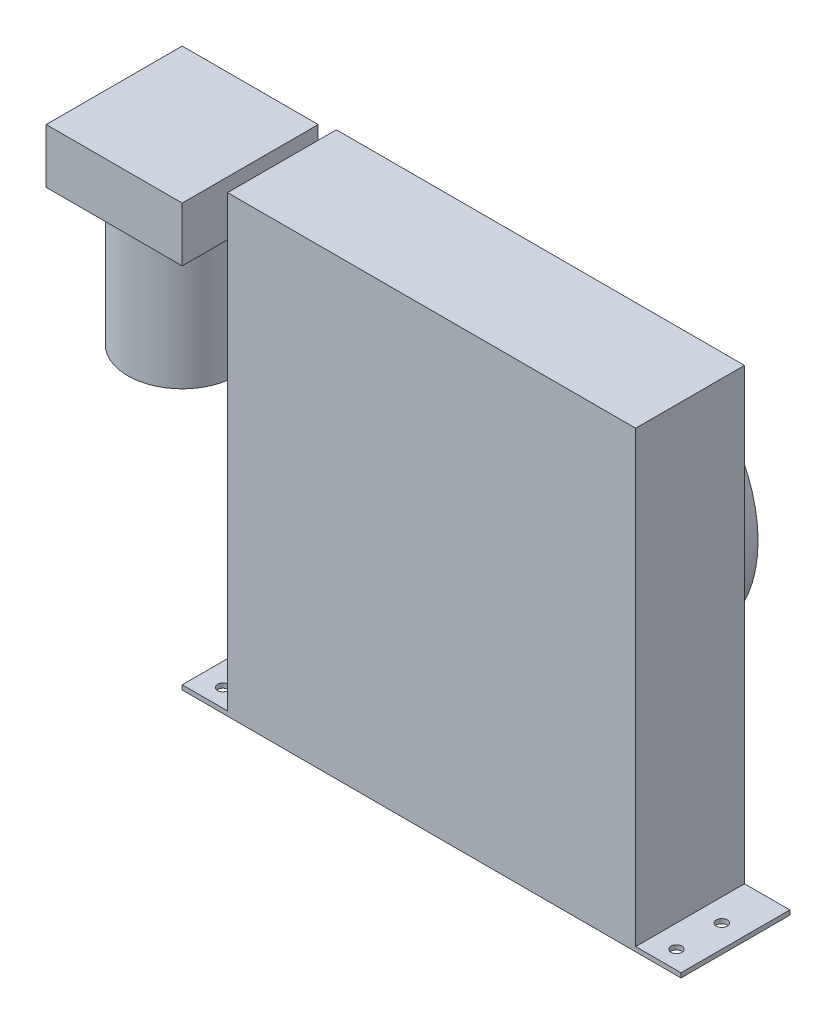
ISO-10303-21;
HEADER;
FILE_DESCRIPTION(('STEP AP214'),'2;1');
FILE_NAME('part.step','',(''),(''),'','','');
FILE_SCHEMA(('AUTOMOTIVE_DESIGN { 1 0 10303 214 1 1 1 1 }'));
ENDSEC;
DATA;
#1=APPLICATION_CONTEXT('core data for automotive mechanical design processes');
#2=APPLICATION_PROTOCOL_DEFINITION('international standard','automotive_design',2000,#1);
#3=PRODUCT_CONTEXT('',#1,'mechanical');
#4=PRODUCT('Part','Part','',(#3));
#5=PRODUCT_RELATED_PRODUCT_CATEGORY('part','',(#4));
#6=PRODUCT_DEFINITION_FORMATION('','',#4);
#7=PRODUCT_DEFINITION_CONTEXT('part definition',#1,'design');
#8=PRODUCT_DEFINITION('design','',#6,#7);
#9=PRODUCT_DEFINITION_SHAPE('','',#8);
#10=(LENGTH_UNIT() NAMED_UNIT(*) SI_UNIT(.MILLI.,.METRE.));
#11=(NAMED_UNIT(*) PLANE_ANGLE_UNIT() SI_UNIT($,.RADIAN.));
#12=(NAMED_UNIT(*) SI_UNIT($,.STERADIAN.) SOLID_ANGLE_UNIT());
#13=UNCERTAINTY_MEASURE_WITH_UNIT(LENGTH_MEASURE(1.E-05),#10,'distance_accuracy_value','');
#14=(GEOMETRIC_REPRESENTATION_CONTEXT(3) GLOBAL_UNCERTAINTY_ASSIGNED_CONTEXT((#13)) GLOBAL_UNIT_ASSIGNED_CONTEXT((#10,
#11,#12)) REPRESENTATION_CONTEXT('',''));
#15=CARTESIAN_POINT('',(0.,0.,0.));
#16=DIRECTION('',(0.,0.,1.));
#17=DIRECTION('',(1.,0.,0.));
#18=AXIS2_PLACEMENT_3D('',#15,#16,#17);
#19=CARTESIAN_POINT('',(-225.,-250.,120.));
#20=DIRECTION('',(0.,1.,0.));
#21=DIRECTION('',(0.,0.,1.));
#22=AXIS2_PLACEMENT_3D('',#19,#20,#21);
#23=PLANE('',#22);
#24=CARTESIAN_POINT('',(250.,-250.,50.));
#25=DIRECTION('',(0.,1.,0.));
#26=DIRECTION('',(0.,0.,-1.));
#27=AXIS2_PLACEMENT_3D('',#24,#25,#26);
#28=CIRCLE('',#27,6.00000000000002);
#29=CARTESIAN_POINT('',(250.,-250.,44.));
#30=VERTEX_POINT('',#29);
#31=EDGE_CURVE('E180',#30,#30,#28,.T.);
#32=ORIENTED_EDGE('',*,*,#31,.T.);
#33=EDGE_LOOP('',(#32));
#34=FACE_BOUND('',#33,.T.);
#35=CARTESIAN_POINT('',(-250.,-250.,100.));
#36=DIRECTION('',(0.,-1.,0.));
#37=DIRECTION('',(0.,0.,-1.));
#38=AXIS2_PLACEMENT_3D('',#35,#36,#37);
#39=CIRCLE('',#38,6.00000000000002);
#40=CARTESIAN_POINT('',(-250.,-250.,94.));
#41=VERTEX_POINT('',#40);
#42=EDGE_CURVE('E166',#41,#41,#39,.T.);
#43=ORIENTED_EDGE('',*,*,#42,.F.);
#44=EDGE_LOOP('',(#43));
#45=FACE_BOUND('',#44,.T.);
#46=CARTESIAN_POINT('',(-250.,-250.,50.));
#47=DIRECTION('',(0.,-1.,0.));
#48=DIRECTION('',(0.,0.,-1.));
#49=AXIS2_PLACEMENT_3D('',#46,#47,#48);
#50=CIRCLE('',#49,6.00000000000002);
#51=CARTESIAN_POINT('',(-250.,-250.,44.));
#52=VERTEX_POINT('',#51);
#53=EDGE_CURVE('E432',#52,#52,#50,.T.);
#54=ORIENTED_EDGE('',*,*,#53,.F.);
#55=EDGE_LOOP('',(#54));
#56=FACE_BOUND('',#55,.T.);
#57=DIRECTION('',(1.,0.,0.));
#58=VECTOR('',#57,1.);
#59=CARTESIAN_POINT('',(-225.,-250.,0.));
#60=LINE('',#59,#58);
#61=CARTESIAN_POINT('',(-275.,-250.,0.));
#62=VERTEX_POINT('',#61);
#63=CARTESIAN_POINT('',(275.,-250.,0.));
#64=VERTEX_POINT('',#63);
#65=EDGE_CURVE('E156',#62,#64,#60,.T.);
#66=ORIENTED_EDGE('',*,*,#65,.T.);
#67=DIRECTION('',(0.,0.,1.));
#68=VECTOR('',#67,1.);
#69=CARTESIAN_POINT('',(275.,-250.,120.));
#70=LINE('',#69,#68);
#71=CARTESIAN_POINT('',(275.,-250.,120.));
#72=VERTEX_POINT('',#71);
#73=EDGE_CURVE('E150',#64,#72,#70,.T.);
#74=ORIENTED_EDGE('',*,*,#73,.T.);
#75=DIRECTION('',(1.,0.,0.));
#76=VECTOR('',#75,1.);
#77=CARTESIAN_POINT('',(-225.,-250.,120.));
#78=LINE('',#77,#76);
#79=CARTESIAN_POINT('',(-275.,-250.,120.));
#80=VERTEX_POINT('',#79);
#81=EDGE_CURVE('E131',#80,#72,#78,.T.);
#82=ORIENTED_EDGE('',*,*,#81,.F.);
#83=DIRECTION('',(0.,0.,1.));
#84=VECTOR('',#83,1.);
#85=CARTESIAN_POINT('',(-275.,-250.,120.));
#86=LINE('',#85,#84);
#87=EDGE_CURVE('E486',#62,#80,#86,.T.);
#88=ORIENTED_EDGE('',*,*,#87,.F.);
#89=EDGE_LOOP('',(#66,#74,#82,#88));
#90=FACE_BOUND('',#89,.T.);
#91=CARTESIAN_POINT('',(250.,-250.,100.));
#92=DIRECTION('',(0.,1.,0.));
#93=DIRECTION('',(0.,0.,-1.));
#94=AXIS2_PLACEMENT_3D('',#91,#92,#93);
#95=CIRCLE('',#94,6.00000000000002);
#96=CARTESIAN_POINT('',(250.,-250.,94.));
#97=VERTEX_POINT('',#96);
#98=EDGE_CURVE('E187',#97,#97,#95,.T.);
#99=ORIENTED_EDGE('',*,*,#98,.T.);
#100=EDGE_LOOP('',(#99));
#101=FACE_BOUND('',#100,.T.);
#102=ADVANCED_FACE('F39',(#34,#45,#56,#90,#101),#23,.F.);
#103=CARTESIAN_POINT('',(275.,-245.,120.));
#104=DIRECTION('',(0.,1.,0.));
#105=DIRECTION('',(0.,0.,1.));
#106=AXIS2_PLACEMENT_3D('',#103,#104,#105);
#107=PLANE('',#106);
#108=CARTESIAN_POINT('',(250.,-245.,50.));
#109=DIRECTION('',(0.,1.,0.));
#110=DIRECTION('',(0.,0.,1.));
#111=AXIS2_PLACEMENT_3D('',#108,#109,#110);
#112=CIRCLE('',#111,6.00000000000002);
#113=CARTESIAN_POINT('',(250.,-245.,56.));
#114=VERTEX_POINT('',#113);
#115=EDGE_CURVE('E171',#114,#114,#112,.F.);
#116=ORIENTED_EDGE('',*,*,#115,.T.);
#117=EDGE_LOOP('',(#116));
#118=FACE_BOUND('',#117,.T.);
#119=DIRECTION('',(0.,0.,-1.));
#120=VECTOR('',#119,1.);
#121=CARTESIAN_POINT('',(225.,-245.,120.));
#122=LINE('',#121,#120);
#123=CARTESIAN_POINT('',(225.,-245.,120.));
#124=VERTEX_POINT('',#123);
#125=CARTESIAN_POINT('',(225.,-245.,0.));
#126=VERTEX_POINT('',#125);
#127=EDGE_CURVE('E153',#124,#126,#122,.T.);
#128=ORIENTED_EDGE('',*,*,#127,.F.);
#129=DIRECTION('',(-1.,0.,0.));
#130=VECTOR('',#129,1.);
#131=CARTESIAN_POINT('',(275.,-245.,120.));
#132=LINE('',#131,#130);
#133=CARTESIAN_POINT('',(275.,-245.,120.));
#134=VERTEX_POINT('',#133);
#135=EDGE_CURVE('E163',#134,#124,#132,.T.);
#136=ORIENTED_EDGE('',*,*,#135,.F.);
#137=DIRECTION('',(0.,0.,-1.));
#138=VECTOR('',#137,1.);
#139=CARTESIAN_POINT('',(275.,-245.,120.));
#140=LINE('',#139,#138);
#141=CARTESIAN_POINT('',(275.,-245.,0.));
#142=VERTEX_POINT('',#141);
#143=EDGE_CURVE('E152',#134,#142,#140,.T.);
#144=ORIENTED_EDGE('',*,*,#143,.T.);
#145=DIRECTION('',(-1.,0.,0.));
#146=VECTOR('',#145,1.);
#147=CARTESIAN_POINT('',(275.,-245.,0.));
#148=LINE('',#147,#146);
#149=EDGE_CURVE('E56',#142,#126,#148,.T.);
#150=ORIENTED_EDGE('',*,*,#149,.T.);
#151=EDGE_LOOP('',(#128,#136,#144,#150));
#152=FACE_BOUND('',#151,.T.);
#153=CARTESIAN_POINT('',(250.,-245.,100.));
#154=DIRECTION('',(0.,1.,0.));
#155=DIRECTION('',(0.,0.,1.));
#156=AXIS2_PLACEMENT_3D('',#153,#154,#155);
#157=CIRCLE('',#156,6.00000000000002);
#158=CARTESIAN_POINT('',(250.,-245.,106.));
#159=VERTEX_POINT('',#158);
#160=EDGE_CURVE('E43',#159,#159,#157,.F.);
#161=ORIENTED_EDGE('',*,*,#160,.T.);
#162=EDGE_LOOP('',(#161));
#163=FACE_BOUND('',#162,.T.);
#164=ADVANCED_FACE('F204',(#118,#152,#163),#107,.T.);
#165=CARTESIAN_POINT('',(-225.,250.,120.));
#166=DIRECTION('',(1.,0.,0.));
#167=DIRECTION('',(0.,1.,0.));
#168=AXIS2_PLACEMENT_3D('',#165,#166,#167);
#169=PLANE('',#168);
#170=CARTESIAN_POINT('',(-225.,190.,60.));
#171=DIRECTION('',(1.,0.,0.));
#172=DIRECTION('',(0.,1.,0.));
#173=AXIS2_PLACEMENT_3D('',#170,#171,#172);
#174=CIRCLE('',#173,20.);
#175=CARTESIAN_POINT('',(-225.,210.,60.));
#176=VERTEX_POINT('',#175);
#177=EDGE_CURVE('E11',#176,#176,#174,.F.);
#178=ORIENTED_EDGE('',*,*,#177,.F.);
#179=EDGE_LOOP('',(#178));
#180=FACE_BOUND('',#179,.T.);
#181=DIRECTION('',(0.,0.,-1.));
#182=VECTOR('',#181,1.);
#183=CARTESIAN_POINT('',(-225.,-245.,120.));
#184=LINE('',#183,#182);
#185=CARTESIAN_POINT('',(-225.,-245.,120.));
#186=VERTEX_POINT('',#185);
#187=CARTESIAN_POINT('',(-225.,-245.,0.));
#188=VERTEX_POINT('',#187);
#189=EDGE_CURVE('E405',#186,#188,#184,.T.);
#190=ORIENTED_EDGE('',*,*,#189,.F.);
#191=DIRECTION('',(0.,-1.,0.));
#192=VECTOR('',#191,1.);
#193=CARTESIAN_POINT('',(-225.,250.,120.));
#194=LINE('',#193,#192);
#195=CARTESIAN_POINT('',(-225.,250.,120.));
#196=VERTEX_POINT('',#195);
#197=EDGE_CURVE('E144',#196,#186,#194,.T.);
#198=ORIENTED_EDGE('',*,*,#197,.F.);
#199=DIRECTION('',(0.,0.,-1.));
#200=VECTOR('',#199,1.);
#201=CARTESIAN_POINT('',(-225.,250.,120.));
#202=LINE('',#201,#200);
#203=CARTESIAN_POINT('',(-225.,250.,0.));
#204=VERTEX_POINT('',#203);
#205=EDGE_CURVE('E423',#196,#204,#202,.T.);
#206=ORIENTED_EDGE('',*,*,#205,.T.);
#207=DIRECTION('',(0.,-1.,0.));
#208=VECTOR('',#207,1.);
#209=CARTESIAN_POINT('',(-225.,250.,0.));
#210=LINE('',#209,#208);
#211=EDGE_CURVE('E408',#204,#188,#210,.T.);
#212=ORIENTED_EDGE('',*,*,#211,.T.);
#213=EDGE_LOOP('',(#190,#198,#206,#212));
#214=FACE_BOUND('',#213,.T.);
#215=ADVANCED_FACE('F41',(#180,#214),#169,.F.);
#216=CARTESIAN_POINT('',(-415.,165.,130.));
#217=DIRECTION('',(0.,-1.,0.));
#218=DIRECTION('',(0.,0.,-1.));
#219=AXIS2_PLACEMENT_3D('',#216,#217,#218);
#220=PLANE('',#219);
#221=DIRECTION('',(0.,0.,1.));
#222=VECTOR('',#221,1.);
#223=CARTESIAN_POINT('',(-415.,165.,130.));
#224=LINE('',#223,#222);
#225=CARTESIAN_POINT('',(-415.,165.,-20.));
#226=VERTEX_POINT('',#225);
#227=CARTESIAN_POINT('',(-415.,165.,130.));
#228=VERTEX_POINT('',#227);
#229=EDGE_CURVE('E462',#226,#228,#224,.T.);
#230=ORIENTED_EDGE('',*,*,#229,.F.);
#231=DIRECTION('',(-1.,0.,0.));
#232=VECTOR('',#231,1.);
#233=CARTESIAN_POINT('',(-415.,165.,-20.));
#234=LINE('',#233,#232);
#235=CARTESIAN_POINT('',(-265.,165.,-20.));
#236=VERTEX_POINT('',#235);
#237=EDGE_CURVE('E449',#236,#226,#234,.T.);
#238=ORIENTED_EDGE('',*,*,#237,.F.);
#239=DIRECTION('',(0.,0.,-1.));
#240=VECTOR('',#239,1.);
#241=CARTESIAN_POINT('',(-265.,165.,130.));
#242=LINE('',#241,#240);
#243=CARTESIAN_POINT('',(-265.,165.,130.));
#244=VERTEX_POINT('',#243);
#245=EDGE_CURVE('E456',#244,#236,#242,.T.);
#246=ORIENTED_EDGE('',*,*,#245,.F.);
#247=DIRECTION('',(1.,0.,0.));
#248=VECTOR('',#247,1.);
#249=CARTESIAN_POINT('',(-415.,165.,130.));
#250=LINE('',#249,#248);
#251=EDGE_CURVE('E459',#228,#244,#250,.T.);
#252=ORIENTED_EDGE('',*,*,#251,.F.);
#253=EDGE_LOOP('',(#230,#238,#246,#252));
#254=FACE_BOUND('',#253,.T.);
#255=CARTESIAN_POINT('',(-340.,165.,55.));
#256=DIRECTION('',(0.,-1.,0.));
#257=DIRECTION('',(0.,0.,-1.));
#258=AXIS2_PLACEMENT_3D('',#255,#256,#257);
#259=CIRCLE('',#258,60.);
#260=CARTESIAN_POINT('',(-340.,165.,-5.00000000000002));
#261=VERTEX_POINT('',#260);
#262=EDGE_CURVE('E480',#261,#261,#259,.T.);
#263=ORIENTED_EDGE('',*,*,#262,.F.);
#264=EDGE_LOOP('',(#263));
#265=FACE_BOUND('',#264,.T.);
#266=ADVANCED_FACE('F226',(#254,#265),#220,.T.);
#267=CARTESIAN_POINT('',(-225.,-250.,0.));
#268=DIRECTION('',(0.,0.,1.));
#269=DIRECTION('',(1.,0.,0.));
#270=AXIS2_PLACEMENT_3D('',#267,#268,#269);
#271=PLANE('',#270);
#272=ORIENTED_EDGE('',*,*,#211,.F.);
#273=DIRECTION('',(-1.,0.,0.));
#274=VECTOR('',#273,1.);
#275=CARTESIAN_POINT('',(-225.,250.,0.));
#276=LINE('',#275,#274);
#277=CARTESIAN_POINT('',(225.,250.,0.));
#278=VERTEX_POINT('',#277);
#279=EDGE_CURVE('E415',#278,#204,#276,.T.);
#280=ORIENTED_EDGE('',*,*,#279,.F.);
#281=DIRECTION('',(0.,1.,0.));
#282=VECTOR('',#281,1.);
#283=CARTESIAN_POINT('',(225.,250.,0.));
#284=LINE('',#283,#282);
#285=EDGE_CURVE('E417',#126,#278,#284,.T.);
#286=ORIENTED_EDGE('',*,*,#285,.F.);
#287=ORIENTED_EDGE('',*,*,#149,.F.);
#288=DIRECTION('',(0.,-1.,0.));
#289=VECTOR('',#288,1.);
#290=CARTESIAN_POINT('',(275.,-250.,0.));
#291=LINE('',#290,#289);
#292=EDGE_CURVE('E157',#142,#64,#291,.T.);
#293=ORIENTED_EDGE('',*,*,#292,.T.);
#294=ORIENTED_EDGE('',*,*,#65,.F.);
#295=DIRECTION('',(0.,-1.,0.));
#296=VECTOR('',#295,1.);
#297=CARTESIAN_POINT('',(-275.,-250.,0.));
#298=LINE('',#297,#296);
#299=CARTESIAN_POINT('',(-275.,-245.,0.));
#300=VERTEX_POINT('',#299);
#301=EDGE_CURVE('E488',#300,#62,#298,.T.);
#302=ORIENTED_EDGE('',*,*,#301,.F.);
#303=DIRECTION('',(1.,0.,0.));
#304=VECTOR('',#303,1.);
#305=CARTESIAN_POINT('',(-275.,-245.,0.));
#306=LINE('',#305,#304);
#307=EDGE_CURVE('E484',#300,#188,#306,.T.);
#308=ORIENTED_EDGE('',*,*,#307,.T.);
#309=EDGE_LOOP('',(#272,#280,#286,#287,#293,#294,#302,#308));
#310=FACE_BOUND('',#309,.T.);
#311=CARTESIAN_POINT('',(0.,0.,0.));
#312=DIRECTION('',(0.,0.,1.));
#313=DIRECTION('',(1.,0.,0.));
#314=AXIS2_PLACEMENT_3D('',#311,#312,#313);
#315=CIRCLE('',#314,150.);
#316=CARTESIAN_POINT('',(150.,0.,0.));
#317=VERTEX_POINT('',#316);
#318=EDGE_CURVE('E48',#317,#317,#315,.F.);
#319=ORIENTED_EDGE('',*,*,#318,.F.);
#320=EDGE_LOOP('',(#319));
#321=FACE_BOUND('',#320,.T.);
#322=ADVANCED_FACE('F216',(#310,#321),#271,.F.);
#323=CARTESIAN_POINT('',(225.,250.,120.));
#324=DIRECTION('',(-1.,0.,0.));
#325=DIRECTION('',(0.,-1.,0.));
#326=AXIS2_PLACEMENT_3D('',#323,#324,#325);
#327=PLANE('',#326);
#328=DIRECTION('',(0.,1.,0.));
#329=VECTOR('',#328,1.);
#330=CARTESIAN_POINT('',(225.,250.,120.));
#331=LINE('',#330,#329);
#332=CARTESIAN_POINT('',(225.,250.,120.));
#333=VERTEX_POINT('',#332);
#334=EDGE_CURVE('E143',#124,#333,#331,.T.);
#335=ORIENTED_EDGE('',*,*,#334,.F.);
#336=ORIENTED_EDGE('',*,*,#127,.T.);
#337=ORIENTED_EDGE('',*,*,#285,.T.);
#338=DIRECTION('',(0.,0.,-1.));
#339=VECTOR('',#338,1.);
#340=CARTESIAN_POINT('',(225.,250.,120.));
#341=LINE('',#340,#339);
#342=EDGE_CURVE('E425',#333,#278,#341,.T.);
#343=ORIENTED_EDGE('',*,*,#342,.F.);
#344=EDGE_LOOP('',(#335,#336,#337,#343));
#345=FACE_BOUND('',#344,.T.);
#346=ADVANCED_FACE('F212',(#345),#327,.F.);
#347=CARTESIAN_POINT('',(-225.,250.,120.));
#348=DIRECTION('',(0.,-1.,0.));
#349=DIRECTION('',(0.,0.,-1.));
#350=AXIS2_PLACEMENT_3D('',#347,#348,#349);
#351=PLANE('',#350);
#352=ORIENTED_EDGE('',*,*,#279,.T.);
#353=ORIENTED_EDGE('',*,*,#205,.F.);
#354=DIRECTION('',(-1.,0.,0.));
#355=VECTOR('',#354,1.);
#356=CARTESIAN_POINT('',(-225.,250.,120.));
#357=LINE('',#356,#355);
#358=EDGE_CURVE('E64',#333,#196,#357,.T.);
#359=ORIENTED_EDGE('',*,*,#358,.F.);
#360=ORIENTED_EDGE('',*,*,#342,.T.);
#361=EDGE_LOOP('',(#352,#353,#359,#360));
#362=FACE_BOUND('',#361,.T.);
#363=ADVANCED_FACE('F215',(#362),#351,.F.);
#364=CARTESIAN_POINT('',(-225.,-250.,120.));
#365=DIRECTION('',(0.,0.,1.));
#366=DIRECTION('',(1.,0.,0.));
#367=AXIS2_PLACEMENT_3D('',#364,#365,#366);
#368=PLANE('',#367);
#369=ORIENTED_EDGE('',*,*,#197,.T.);
#370=DIRECTION('',(1.,0.,0.));
#371=VECTOR('',#370,1.);
#372=CARTESIAN_POINT('',(-275.,-245.,120.));
#373=LINE('',#372,#371);
#374=CARTESIAN_POINT('',(-275.,-245.,120.));
#375=VERTEX_POINT('',#374);
#376=EDGE_CURVE('E414',#375,#186,#373,.T.);
#377=ORIENTED_EDGE('',*,*,#376,.F.);
#378=DIRECTION('',(0.,1.,0.));
#379=VECTOR('',#378,1.);
#380=CARTESIAN_POINT('',(-275.,-250.,120.));
#381=LINE('',#380,#379);
#382=EDGE_CURVE('E138',#80,#375,#381,.T.);
#383=ORIENTED_EDGE('',*,*,#382,.F.);
#384=ORIENTED_EDGE('',*,*,#81,.T.);
#385=DIRECTION('',(0.,1.,0.));
#386=VECTOR('',#385,1.);
#387=CARTESIAN_POINT('',(275.,-250.,120.));
#388=LINE('',#387,#386);
#389=EDGE_CURVE('E134',#72,#134,#388,.T.);
#390=ORIENTED_EDGE('',*,*,#389,.T.);
#391=ORIENTED_EDGE('',*,*,#135,.T.);
#392=ORIENTED_EDGE('',*,*,#334,.T.);
#393=ORIENTED_EDGE('',*,*,#358,.T.);
#394=EDGE_LOOP('',(#369,#377,#383,#384,#390,#391,#392,#393));
#395=FACE_BOUND('',#394,.T.);
#396=ADVANCED_FACE('F133',(#395),#368,.T.);
#397=CARTESIAN_POINT('',(0.,0.,-90.));
#398=DIRECTION('',(0.,0.,1.));
#399=DIRECTION('',(1.,0.,0.));
#400=AXIS2_PLACEMENT_3D('',#397,#398,#399);
#401=CYLINDRICAL_SURFACE('',#400,150.);
#402=CARTESIAN_POINT('',(0.,0.,-90.));
#403=DIRECTION('',(0.,0.,-1.));
#404=DIRECTION('',(-1.,0.,0.));
#405=AXIS2_PLACEMENT_3D('',#402,#403,#404);
#406=CIRCLE('',#405,150.);
#407=CARTESIAN_POINT('',(150.,0.,-90.));
#408=VERTEX_POINT('',#407);
#409=EDGE_CURVE('E439',#408,#408,#406,.T.);
#410=CARTESIAN_POINT('',(150.,0.,-90.));
#411=CARTESIAN_POINT('',(150.,0.,-89.0625));
#412=CARTESIAN_POINT('',(150.,0.,-88.125));
#413=CARTESIAN_POINT('',(150.,0.,-86.25));
#414=CARTESIAN_POINT('',(150.,0.,-85.3125));
#415=CARTESIAN_POINT('',(150.,0.,-83.4375));
#416=CARTESIAN_POINT('',(150.,0.,-82.5));
#417=CARTESIAN_POINT('',(150.,0.,-80.625));
#418=CARTESIAN_POINT('',(150.,0.,-79.6875));
#419=CARTESIAN_POINT('',(150.,0.,-77.8125));
#420=CARTESIAN_POINT('',(150.,0.,-76.875));
#421=CARTESIAN_POINT('',(150.,0.,-75.));
#422=CARTESIAN_POINT('',(150.,0.,-74.0625));
#423=CARTESIAN_POINT('',(150.,0.,-72.1875));
#424=CARTESIAN_POINT('',(150.,0.,-71.25));
#425=CARTESIAN_POINT('',(150.,0.,-69.375));
#426=CARTESIAN_POINT('',(150.,0.,-68.4375));
#427=CARTESIAN_POINT('',(150.,0.,-66.5625));
#428=CARTESIAN_POINT('',(150.,0.,-65.625));
#429=CARTESIAN_POINT('',(150.,0.,-63.75));
#430=CARTESIAN_POINT('',(150.,0.,-62.8125));
#431=CARTESIAN_POINT('',(150.,0.,-60.9375));
#432=CARTESIAN_POINT('',(150.,0.,-60.));
#433=CARTESIAN_POINT('',(150.,0.,-58.125));
#434=CARTESIAN_POINT('',(150.,0.,-57.1875));
#435=CARTESIAN_POINT('',(150.,0.,-55.3125));
#436=CARTESIAN_POINT('',(150.,0.,-54.375));
#437=CARTESIAN_POINT('',(150.,0.,-52.5));
#438=CARTESIAN_POINT('',(150.,0.,-51.5625));
#439=CARTESIAN_POINT('',(150.,0.,-49.6875));
#440=CARTESIAN_POINT('',(150.,0.,-48.75));
#441=CARTESIAN_POINT('',(150.,0.,-46.875));
#442=CARTESIAN_POINT('',(150.,0.,-45.9375));
#443=CARTESIAN_POINT('',(150.,0.,-44.0625));
#444=CARTESIAN_POINT('',(150.,0.,-43.125));
#445=CARTESIAN_POINT('',(150.,0.,-41.25));
#446=CARTESIAN_POINT('',(150.,0.,-40.3125));
#447=CARTESIAN_POINT('',(150.,0.,-38.4375));
#448=CARTESIAN_POINT('',(150.,0.,-37.5));
#449=CARTESIAN_POINT('',(150.,0.,-35.625));
#450=CARTESIAN_POINT('',(150.,0.,-34.6875));
#451=CARTESIAN_POINT('',(150.,0.,-32.8125));
#452=CARTESIAN_POINT('',(150.,0.,-31.875));
#453=CARTESIAN_POINT('',(150.,0.,-30.));
#454=CARTESIAN_POINT('',(150.,0.,-29.0625));
#455=CARTESIAN_POINT('',(150.,0.,-27.1875));
#456=CARTESIAN_POINT('',(150.,0.,-26.25));
#457=CARTESIAN_POINT('',(150.,0.,-24.375));
#458=CARTESIAN_POINT('',(150.,0.,-23.4375));
#459=CARTESIAN_POINT('',(150.,0.,-21.5625));
#460=CARTESIAN_POINT('',(150.,0.,-20.625));
#461=CARTESIAN_POINT('',(150.,0.,-18.75));
#462=CARTESIAN_POINT('',(150.,0.,-17.8125));
#463=CARTESIAN_POINT('',(150.,0.,-15.9375));
#464=CARTESIAN_POINT('',(150.,0.,-15.));
#465=CARTESIAN_POINT('',(150.,0.,-13.125));
#466=CARTESIAN_POINT('',(150.,0.,-12.1875));
#467=CARTESIAN_POINT('',(150.,0.,-10.3125));
#468=CARTESIAN_POINT('',(150.,0.,-9.37500000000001));
#469=CARTESIAN_POINT('',(150.,0.,-7.50000000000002));
#470=CARTESIAN_POINT('',(150.,0.,-6.56250000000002));
#471=CARTESIAN_POINT('',(150.,0.,-4.68750000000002));
#472=CARTESIAN_POINT('',(150.,0.,-3.75000000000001));
#473=CARTESIAN_POINT('',(150.,0.,-1.87500000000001));
#474=CARTESIAN_POINT('',(150.,0.,-0.937500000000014));
#475=CARTESIAN_POINT('',(150.,0.,0.));
#476=B_SPLINE_CURVE_WITH_KNOTS('',3,(#410,#411,#412,#413,#414,#415,#416,#417,#418,#419,#420,
#421,#422,#423,#424,#425,#426,#427,#428,#429,#430,#431,#432,#433,#434,#435,#436,#437,#438,#439,
#440,#441,#442,#443,#444,#445,#446,#447,#448,#449,#450,#451,#452,#453,#454,#455,#456,#457,#458,
#459,#460,#461,#462,#463,#464,#465,#466,#467,#468,#469,#470,#471,#472,#473,#474,#475),
.UNSPECIFIED.,.F.,.F.,(4,2,2,2,2,2,2,2,2,2,2,2,2,2,2,2,2,2,2,2,2,2,2,2,2,2,2,2,2,2,2,2,4),(0.,
2.8125,5.62499999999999,8.43749999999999,11.25,14.0625,16.875,19.6875,22.5,25.3125,28.125,
30.9375,33.75,36.5625,39.375,42.1875,45.,47.8125,50.625,53.4375,56.25,59.0625,61.875,64.6875,
67.5,70.3125,73.125,75.9375,78.75,81.5625,84.375,87.1875,90.),.UNSPECIFIED.);
#477=EDGE_CURVE('BSEAM223',#408,#317,#476,.T.);
#478=ORIENTED_EDGE('',*,*,#409,.F.);
#479=ORIENTED_EDGE('',*,*,#318,.T.);
#480=ORIENTED_EDGE('',*,*,#477,.T.);
#481=ORIENTED_EDGE('',*,*,#477,.F.);
#482=EDGE_LOOP('',(#478,#480,#479,#481));
#483=FACE_BOUND('',#482,.T.);
#484=ADVANCED_FACE('F223',(#483),#401,.T.);
#485=CARTESIAN_POINT('',(0.,0.,-90.));
#486=DIRECTION('',(0.,0.,-1.));
#487=DIRECTION('',(-1.,0.,0.));
#488=AXIS2_PLACEMENT_3D('',#485,#486,#487);
#489=PLANE('',#488);
#490=ORIENTED_EDGE('',*,*,#409,.T.);
#491=EDGE_LOOP('',(#490));
#492=FACE_BOUND('',#491,.T.);
#493=ADVANCED_FACE('F230',(#492),#489,.T.);
#494=CARTESIAN_POINT('',(-265.,190.,60.));
#495=DIRECTION('',(1.,0.,0.));
#496=DIRECTION('',(0.,1.,0.));
#497=AXIS2_PLACEMENT_3D('',#494,#495,#496);
#498=CYLINDRICAL_SURFACE('',#497,20.);
#499=CARTESIAN_POINT('',(-265.,190.,60.));
#500=DIRECTION('',(-1.,0.,0.));
#501=DIRECTION('',(0.,-1.,0.));
#502=AXIS2_PLACEMENT_3D('',#499,#500,#501);
#503=CIRCLE('',#502,20.);
#504=CARTESIAN_POINT('',(-265.,170.,60.));
#505=VERTEX_POINT('',#504);
#506=EDGE_CURVE('E442',#505,#505,#503,.T.);
#507=ORIENTED_EDGE('',*,*,#506,.F.);
#508=EDGE_LOOP('',(#507));
#509=FACE_BOUND('',#508,.T.);
#510=ORIENTED_EDGE('',*,*,#177,.T.);
#511=EDGE_LOOP('',(#510));
#512=FACE_BOUND('',#511,.T.);
#513=ADVANCED_FACE('F234',(#509,#512),#498,.T.);
#514=CARTESIAN_POINT('',(-265.,165.,130.));
#515=DIRECTION('',(1.,0.,0.));
#516=DIRECTION('',(0.,0.,-1.));
#517=AXIS2_PLACEMENT_3D('',#514,#515,#516);
#518=PLANE('',#517);
#519=DIRECTION('',(0.,0.,-1.));
#520=VECTOR('',#519,1.);
#521=CARTESIAN_POINT('',(-265.,225.,130.));
#522=LINE('',#521,#520);
#523=CARTESIAN_POINT('',(-265.,225.,130.));
#524=VERTEX_POINT('',#523);
#525=CARTESIAN_POINT('',(-265.,225.,-20.));
#526=VERTEX_POINT('',#525);
#527=EDGE_CURVE('E468',#524,#526,#522,.T.);
#528=ORIENTED_EDGE('',*,*,#527,.F.);
#529=DIRECTION('',(0.,1.,0.));
#530=VECTOR('',#529,1.);
#531=CARTESIAN_POINT('',(-265.,165.,130.));
#532=LINE('',#531,#530);
#533=EDGE_CURVE('E448',#244,#524,#532,.T.);
#534=ORIENTED_EDGE('',*,*,#533,.F.);
#535=ORIENTED_EDGE('',*,*,#245,.T.);
#536=DIRECTION('',(0.,1.,0.));
#537=VECTOR('',#536,1.);
#538=CARTESIAN_POINT('',(-265.,165.,-20.));
#539=LINE('',#538,#537);
#540=EDGE_CURVE('E451',#236,#526,#539,.T.);
#541=ORIENTED_EDGE('',*,*,#540,.T.);
#542=EDGE_LOOP('',(#528,#534,#535,#541));
#543=FACE_BOUND('',#542,.T.);
#544=ORIENTED_EDGE('',*,*,#506,.T.);
#545=EDGE_LOOP('',(#544));
#546=FACE_BOUND('',#545,.T.);
#547=ADVANCED_FACE('F238',(#543,#546),#518,.T.);
#548=CARTESIAN_POINT('',(-415.,165.,130.));
#549=DIRECTION('',(-1.,0.,0.));
#550=DIRECTION('',(0.,0.,1.));
#551=AXIS2_PLACEMENT_3D('',#548,#549,#550);
#552=PLANE('',#551);
#553=DIRECTION('',(0.,0.,1.));
#554=VECTOR('',#553,1.);
#555=CARTESIAN_POINT('',(-415.,225.,130.));
#556=LINE('',#555,#554);
#557=CARTESIAN_POINT('',(-415.,225.,-20.));
#558=VERTEX_POINT('',#557);
#559=CARTESIAN_POINT('',(-415.,225.,130.));
#560=VERTEX_POINT('',#559);
#561=EDGE_CURVE('E474',#558,#560,#556,.T.);
#562=ORIENTED_EDGE('',*,*,#561,.F.);
#563=DIRECTION('',(0.,1.,0.));
#564=VECTOR('',#563,1.);
#565=CARTESIAN_POINT('',(-415.,165.,-20.));
#566=LINE('',#565,#564);
#567=EDGE_CURVE('E445',#226,#558,#566,.T.);
#568=ORIENTED_EDGE('',*,*,#567,.F.);
#569=ORIENTED_EDGE('',*,*,#229,.T.);
#570=DIRECTION('',(0.,1.,0.));
#571=VECTOR('',#570,1.);
#572=CARTESIAN_POINT('',(-415.,165.,130.));
#573=LINE('',#572,#571);
#574=EDGE_CURVE('E446',#228,#560,#573,.T.);
#575=ORIENTED_EDGE('',*,*,#574,.T.);
#576=EDGE_LOOP('',(#562,#568,#569,#575));
#577=FACE_BOUND('',#576,.T.);
#578=ADVANCED_FACE('F240',(#577),#552,.T.);
#579=CARTESIAN_POINT('',(-415.,165.,-20.));
#580=DIRECTION('',(0.,0.,-1.));
#581=DIRECTION('',(-1.,0.,0.));
#582=AXIS2_PLACEMENT_3D('',#579,#580,#581);
#583=PLANE('',#582);
#584=DIRECTION('',(-1.,0.,0.));
#585=VECTOR('',#584,1.);
#586=CARTESIAN_POINT('',(-415.,225.,-20.));
#587=LINE('',#586,#585);
#588=EDGE_CURVE('E465',#526,#558,#587,.T.);
#589=ORIENTED_EDGE('',*,*,#588,.F.);
#590=ORIENTED_EDGE('',*,*,#540,.F.);
#591=ORIENTED_EDGE('',*,*,#237,.T.);
#592=ORIENTED_EDGE('',*,*,#567,.T.);
#593=EDGE_LOOP('',(#589,#590,#591,#592));
#594=FACE_BOUND('',#593,.T.);
#595=ADVANCED_FACE('F243',(#594),#583,.T.);
#596=CARTESIAN_POINT('',(-415.,165.,130.));
#597=DIRECTION('',(0.,0.,1.));
#598=DIRECTION('',(1.,0.,0.));
#599=AXIS2_PLACEMENT_3D('',#596,#597,#598);
#600=PLANE('',#599);
#601=DIRECTION('',(1.,0.,0.));
#602=VECTOR('',#601,1.);
#603=CARTESIAN_POINT('',(-415.,225.,130.));
#604=LINE('',#603,#602);
#605=EDGE_CURVE('E471',#560,#524,#604,.T.);
#606=ORIENTED_EDGE('',*,*,#605,.F.);
#607=ORIENTED_EDGE('',*,*,#574,.F.);
#608=ORIENTED_EDGE('',*,*,#251,.T.);
#609=ORIENTED_EDGE('',*,*,#533,.T.);
#610=EDGE_LOOP('',(#606,#607,#608,#609));
#611=FACE_BOUND('',#610,.T.);
#612=ADVANCED_FACE('F245',(#611),#600,.T.);
#613=CARTESIAN_POINT('',(-415.,225.,130.));
#614=DIRECTION('',(0.,-1.,0.));
#615=DIRECTION('',(0.,0.,-1.));
#616=AXIS2_PLACEMENT_3D('',#613,#614,#615);
#617=PLANE('',#616);
#618=ORIENTED_EDGE('',*,*,#561,.T.);
#619=ORIENTED_EDGE('',*,*,#605,.T.);
#620=ORIENTED_EDGE('',*,*,#527,.T.);
#621=ORIENTED_EDGE('',*,*,#588,.T.);
#622=EDGE_LOOP('',(#618,#619,#620,#621));
#623=FACE_BOUND('',#622,.T.);
#624=ADVANCED_FACE('F248',(#623),#617,.F.);
#625=CARTESIAN_POINT('',(-340.,15.,55.));
#626=DIRECTION('',(0.,1.,0.));
#627=DIRECTION('',(0.,0.,1.));
#628=AXIS2_PLACEMENT_3D('',#625,#626,#627);
#629=CYLINDRICAL_SURFACE('',#628,60.);
#630=CARTESIAN_POINT('',(-340.,15.,55.));
#631=DIRECTION('',(0.,-1.,0.));
#632=DIRECTION('',(0.,0.,-1.));
#633=AXIS2_PLACEMENT_3D('',#630,#631,#632);
#634=CIRCLE('',#633,60.);
#635=CARTESIAN_POINT('',(-340.,15.,-5.00000000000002));
#636=VERTEX_POINT('',#635);
#637=EDGE_CURVE('E477',#636,#636,#634,.T.);
#638=ORIENTED_EDGE('',*,*,#637,.F.);
#639=EDGE_LOOP('',(#638));
#640=FACE_BOUND('',#639,.T.);
#641=ORIENTED_EDGE('',*,*,#262,.T.);
#642=EDGE_LOOP('',(#641));
#643=FACE_BOUND('',#642,.T.);
#644=ADVANCED_FACE('F261',(#640,#643),#629,.T.);
#645=CARTESIAN_POINT('',(-340.,15.,55.));
#646=DIRECTION('',(0.,-1.,0.));
#647=DIRECTION('',(0.,0.,-1.));
#648=AXIS2_PLACEMENT_3D('',#645,#646,#647);
#649=PLANE('',#648);
#650=ORIENTED_EDGE('',*,*,#637,.T.);
#651=EDGE_LOOP('',(#650));
#652=FACE_BOUND('',#651,.T.);
#653=ADVANCED_FACE('F265',(#652),#649,.T.);
#654=CARTESIAN_POINT('',(-275.,-245.,120.));
#655=DIRECTION('',(0.,-1.,0.));
#656=DIRECTION('',(0.,0.,-1.));
#657=AXIS2_PLACEMENT_3D('',#654,#655,#656);
#658=PLANE('',#657);
#659=CARTESIAN_POINT('',(-250.,-245.,100.));
#660=DIRECTION('',(0.,-1.,0.));
#661=DIRECTION('',(0.,0.,-1.));
#662=AXIS2_PLACEMENT_3D('',#659,#660,#661);
#663=CIRCLE('',#662,6.00000000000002);
#664=CARTESIAN_POINT('',(-250.,-245.,94.));
#665=VERTEX_POINT('',#664);
#666=EDGE_CURVE('E433',#665,#665,#663,.T.);
#667=ORIENTED_EDGE('',*,*,#666,.T.);
#668=EDGE_LOOP('',(#667));
#669=FACE_BOUND('',#668,.T.);
#670=CARTESIAN_POINT('',(-250.,-245.,50.));
#671=DIRECTION('',(0.,-1.,0.));
#672=DIRECTION('',(0.,0.,-1.));
#673=AXIS2_PLACEMENT_3D('',#670,#671,#672);
#674=CIRCLE('',#673,6.00000000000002);
#675=CARTESIAN_POINT('',(-250.,-245.,44.));
#676=VERTEX_POINT('',#675);
#677=EDGE_CURVE('E412',#676,#676,#674,.T.);
#678=ORIENTED_EDGE('',*,*,#677,.T.);
#679=EDGE_LOOP('',(#678));
#680=FACE_BOUND('',#679,.T.);
#681=ORIENTED_EDGE('',*,*,#189,.T.);
#682=ORIENTED_EDGE('',*,*,#307,.F.);
#683=DIRECTION('',(0.,0.,-1.));
#684=VECTOR('',#683,1.);
#685=CARTESIAN_POINT('',(-275.,-245.,120.));
#686=LINE('',#685,#684);
#687=EDGE_CURVE('E491',#375,#300,#686,.T.);
#688=ORIENTED_EDGE('',*,*,#687,.F.);
#689=ORIENTED_EDGE('',*,*,#376,.T.);
#690=EDGE_LOOP('',(#681,#682,#688,#689));
#691=FACE_BOUND('',#690,.T.);
#692=ADVANCED_FACE('F269',(#669,#680,#691),#658,.F.);
#693=CARTESIAN_POINT('',(-275.,-250.,120.));
#694=DIRECTION('',(-1.,0.,0.));
#695=DIRECTION('',(0.,0.,1.));
#696=AXIS2_PLACEMENT_3D('',#693,#694,#695);
#697=PLANE('',#696);
#698=ORIENTED_EDGE('',*,*,#382,.T.);
#699=ORIENTED_EDGE('',*,*,#687,.T.);
#700=ORIENTED_EDGE('',*,*,#301,.T.);
#701=ORIENTED_EDGE('',*,*,#87,.T.);
#702=EDGE_LOOP('',(#698,#699,#700,#701));
#703=FACE_BOUND('',#702,.T.);
#704=ADVANCED_FACE('F273',(#703),#697,.T.);
#705=CARTESIAN_POINT('',(-250.,-200.,50.));
#706=DIRECTION('',(0.,-1.,0.));
#707=DIRECTION('',(0.,0.,-1.));
#708=AXIS2_PLACEMENT_3D('',#705,#706,#707);
#709=CYLINDRICAL_SURFACE('',#708,6.00000000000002);
#710=ORIENTED_EDGE('',*,*,#53,.T.);
#711=EDGE_LOOP('',(#710));
#712=FACE_BOUND('',#711,.T.);
#713=ORIENTED_EDGE('',*,*,#677,.F.);
#714=EDGE_LOOP('',(#713));
#715=FACE_BOUND('',#714,.T.);
#716=ADVANCED_FACE('F277',(#712,#715),#709,.F.);
#717=CARTESIAN_POINT('',(-250.,-200.,100.));
#718=DIRECTION('',(0.,-1.,0.));
#719=DIRECTION('',(0.,0.,-1.));
#720=AXIS2_PLACEMENT_3D('',#717,#718,#719);
#721=CYLINDRICAL_SURFACE('',#720,6.00000000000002);
#722=ORIENTED_EDGE('',*,*,#42,.T.);
#723=EDGE_LOOP('',(#722));
#724=FACE_BOUND('',#723,.T.);
#725=ORIENTED_EDGE('',*,*,#666,.F.);
#726=EDGE_LOOP('',(#725));
#727=FACE_BOUND('',#726,.T.);
#728=ADVANCED_FACE('F281',(#724,#727),#721,.F.);
#729=CARTESIAN_POINT('',(275.,-250.,120.));
#730=DIRECTION('',(1.,0.,0.));
#731=DIRECTION('',(0.,0.,1.));
#732=AXIS2_PLACEMENT_3D('',#729,#730,#731);
#733=PLANE('',#732);
#734=ORIENTED_EDGE('',*,*,#389,.F.);
#735=ORIENTED_EDGE('',*,*,#73,.F.);
#736=ORIENTED_EDGE('',*,*,#292,.F.);
#737=ORIENTED_EDGE('',*,*,#143,.F.);
#738=EDGE_LOOP('',(#734,#735,#736,#737));
#739=FACE_BOUND('',#738,.T.);
#740=ADVANCED_FACE('F148',(#739),#733,.T.);
#741=CARTESIAN_POINT('',(250.,-200.,50.));
#742=DIRECTION('',(0.,-1.,0.));
#743=DIRECTION('',(0.,0.,-1.));
#744=AXIS2_PLACEMENT_3D('',#741,#742,#743);
#745=CYLINDRICAL_SURFACE('',#744,6.00000000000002);
#746=ORIENTED_EDGE('',*,*,#115,.F.);
#747=EDGE_LOOP('',(#746));
#748=FACE_BOUND('',#747,.T.);
#749=ORIENTED_EDGE('',*,*,#31,.F.);
#750=EDGE_LOOP('',(#749));
#751=FACE_BOUND('',#750,.T.);
#752=ADVANCED_FACE('F194',(#748,#751),#745,.F.);
#753=CARTESIAN_POINT('',(250.,-200.,100.));
#754=DIRECTION('',(0.,-1.,0.));
#755=DIRECTION('',(0.,0.,-1.));
#756=AXIS2_PLACEMENT_3D('',#753,#754,#755);
#757=CYLINDRICAL_SURFACE('',#756,6.00000000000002);
#758=ORIENTED_EDGE('',*,*,#160,.F.);
#759=EDGE_LOOP('',(#758));
#760=FACE_BOUND('',#759,.T.);
#761=ORIENTED_EDGE('',*,*,#98,.F.);
#762=EDGE_LOOP('',(#761));
#763=FACE_BOUND('',#762,.T.);
#764=ADVANCED_FACE('F192',(#760,#763),#757,.F.);
#765=CLOSED_SHELL('',(#102,#164,#215,#266,#322,#346,#363,#396,#484,#493,#513,#547,#578,#595,
#612,#624,#644,#653,#692,#704,#716,#728,#740,#752,#764));
#766=MANIFOLD_SOLID_BREP('B2',#765);
#767=ADVANCED_BREP_SHAPE_REPRESENTATION('',(#18,#766),#14);
#768=SHAPE_DEFINITION_REPRESENTATION(#9,#767);
ENDSEC;
END-ISO-10303-21;
